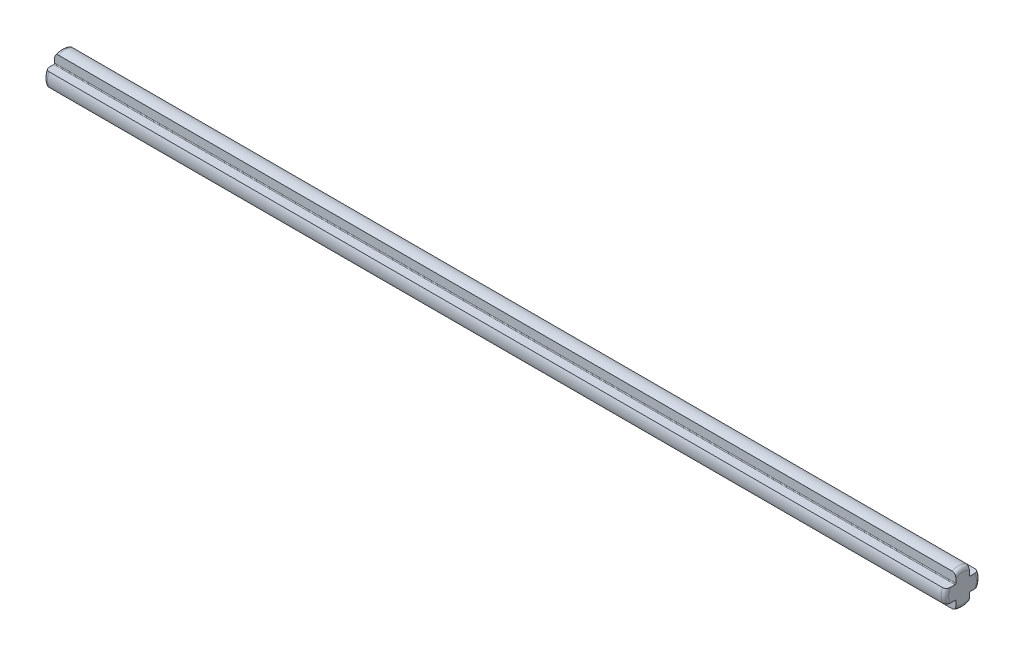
ISO-10303-21;
HEADER;
FILE_DESCRIPTION(('STEP AP214'),'2;1');
FILE_NAME('part.step','',(''),(''),'','','');
FILE_SCHEMA(('AUTOMOTIVE_DESIGN { 1 0 10303 214 1 1 1 1 }'));
ENDSEC;
DATA;
#1=APPLICATION_CONTEXT('core data for automotive mechanical design processes');
#2=APPLICATION_PROTOCOL_DEFINITION('international standard','automotive_design',2000,#1);
#3=PRODUCT_CONTEXT('',#1,'mechanical');
#4=PRODUCT('Part','Part','',(#3));
#5=PRODUCT_RELATED_PRODUCT_CATEGORY('part','',(#4));
#6=PRODUCT_DEFINITION_FORMATION('','',#4);
#7=PRODUCT_DEFINITION_CONTEXT('part definition',#1,'design');
#8=PRODUCT_DEFINITION('design','',#6,#7);
#9=PRODUCT_DEFINITION_SHAPE('','',#8);
#10=(LENGTH_UNIT() NAMED_UNIT(*) SI_UNIT(.MILLI.,.METRE.));
#11=(NAMED_UNIT(*) PLANE_ANGLE_UNIT() SI_UNIT($,.RADIAN.));
#12=(NAMED_UNIT(*) SI_UNIT($,.STERADIAN.) SOLID_ANGLE_UNIT());
#13=UNCERTAINTY_MEASURE_WITH_UNIT(LENGTH_MEASURE(1.E-05),#10,'distance_accuracy_value','');
#14=(GEOMETRIC_REPRESENTATION_CONTEXT(3) GLOBAL_UNCERTAINTY_ASSIGNED_CONTEXT((#13)) GLOBAL_UNIT_ASSIGNED_CONTEXT((#10,
#11,#12)) REPRESENTATION_CONTEXT('',''));
#15=CARTESIAN_POINT('',(0.,0.,0.));
#16=DIRECTION('',(0.,0.,1.));
#17=DIRECTION('',(1.,0.,0.));
#18=AXIS2_PLACEMENT_3D('',#15,#16,#17);
#19=CARTESIAN_POINT('',(60.,0.,0.));
#20=DIRECTION('',(-1.,0.,0.));
#21=DIRECTION('',(0.,0.,1.));
#22=AXIS2_PLACEMENT_3D('',#19,#20,#21);
#23=CYLINDRICAL_SURFACE('',#22,2.35);
#24=DIRECTION('',(-1.,0.,0.));
#25=VECTOR('',#24,1.);
#26=CARTESIAN_POINT('',(60.,0.9,2.17082933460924));
#27=LINE('',#26,#25);
#28=CARTESIAN_POINT('',(59.5,0.9,2.17082933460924));
#29=VERTEX_POINT('',#28);
#30=CARTESIAN_POINT('',(-59.5,0.9,2.17082933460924));
#31=VERTEX_POINT('',#30);
#32=EDGE_CURVE('E250',#29,#31,#27,.T.);
#33=ORIENTED_EDGE('',*,*,#32,.T.);
#34=CARTESIAN_POINT('',(-59.5,0.,0.));
#35=DIRECTION('',(1.,0.,0.));
#36=DIRECTION('',(0.,0.,-1.));
#37=AXIS2_PLACEMENT_3D('',#34,#35,#36);
#38=CIRCLE('',#37,2.35);
#39=CARTESIAN_POINT('',(-59.5,-0.900000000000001,2.17082933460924));
#40=VERTEX_POINT('',#39);
#41=EDGE_CURVE('E515',#31,#40,#38,.T.);
#42=ORIENTED_EDGE('',*,*,#41,.T.);
#43=DIRECTION('',(-1.,0.,0.));
#44=VECTOR('',#43,1.);
#45=CARTESIAN_POINT('',(60.,-0.900000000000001,2.17082933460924));
#46=LINE('',#45,#44);
#47=CARTESIAN_POINT('',(59.5,-0.900000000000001,2.17082933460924));
#48=VERTEX_POINT('',#47);
#49=EDGE_CURVE('E221',#48,#40,#46,.T.);
#50=ORIENTED_EDGE('',*,*,#49,.F.);
#51=CARTESIAN_POINT('',(59.5,0.,0.));
#52=DIRECTION('',(1.,0.,0.));
#53=DIRECTION('',(0.,0.,-1.));
#54=AXIS2_PLACEMENT_3D('',#51,#52,#53);
#55=CIRCLE('',#54,2.35);
#56=EDGE_CURVE('E370',#48,#29,#55,.F.);
#57=ORIENTED_EDGE('',*,*,#56,.T.);
#58=EDGE_LOOP('',(#33,#42,#50,#57));
#59=FACE_BOUND('',#58,.T.);
#60=ADVANCED_FACE('F37',(#59),#23,.T.);
#61=CARTESIAN_POINT('',(60.,-0.900000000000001,2.17082933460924));
#62=DIRECTION('',(0.,1.,0.));
#63=DIRECTION('',(0.,0.,1.));
#64=AXIS2_PLACEMENT_3D('',#61,#62,#63);
#65=PLANE('',#64);
#66=ORIENTED_EDGE('',*,*,#49,.T.);
#67=CARTESIAN_POINT('',(-59.5,-0.900000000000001,2.17082933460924));
#68=CARTESIAN_POINT('',(-59.5264833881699,-0.900000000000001,2.17085986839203));
#69=CARTESIAN_POINT('',(-59.5529498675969,-0.900000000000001,2.16855372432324));
#70=CARTESIAN_POINT('',(-59.6050453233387,-0.900000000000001,2.15950506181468));
#71=CARTESIAN_POINT('',(-59.6306762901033,-0.900000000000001,2.15277404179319));
#72=CARTESIAN_POINT('',(-59.6804387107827,-0.900000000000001,2.1351114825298));
#73=CARTESIAN_POINT('',(-59.7045703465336,-0.900000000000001,2.12418045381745));
#74=CARTESIAN_POINT('',(-59.7507251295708,-0.900000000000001,2.09852306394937));
#75=CARTESIAN_POINT('',(-59.7727475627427,-0.900000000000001,2.0837954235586));
#76=CARTESIAN_POINT('',(-59.8147234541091,-0.900000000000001,2.05060839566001));
#77=CARTESIAN_POINT('',(-59.8346070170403,-0.900000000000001,2.03206082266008));
#78=CARTESIAN_POINT('',(-59.8712243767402,-0.900000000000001,1.99209288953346));
#79=CARTESIAN_POINT('',(-59.8879579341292,-0.900000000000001,1.97067231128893));
#80=CARTESIAN_POINT('',(-59.9190973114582,-0.900000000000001,1.92396602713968));
#81=CARTESIAN_POINT('',(-59.9332527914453,-0.900000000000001,1.89851375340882));
#82=CARTESIAN_POINT('',(-59.9575247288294,-0.900000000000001,1.84573102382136));
#83=CARTESIAN_POINT('',(-59.9676367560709,-0.900000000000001,1.81839854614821));
#84=CARTESIAN_POINT('',(-59.9838866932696,-0.900000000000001,1.76219756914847));
#85=CARTESIAN_POINT('',(-59.9899702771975,-0.900000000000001,1.73331353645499));
#86=CARTESIAN_POINT('',(-59.9980270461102,-0.900000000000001,1.67505065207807));
#87=CARTESIAN_POINT('',(-60.0000109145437,-0.900000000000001,1.64567328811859));
#88=CARTESIAN_POINT('',(-60.,-0.900000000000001,1.61632298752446));
#89=B_SPLINE_CURVE_WITH_KNOTS('',3,(#67,#68,#69,#70,#71,#72,#73,#74,#75,#76,#77,#78,#79,#80,#81,
#82,#83,#84,#85,#86,#87,#88),.UNSPECIFIED.,.F.,.F.,(4,2,2,2,2,2,2,2,2,2,4),(0.,
0.0793238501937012,0.158442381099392,0.237551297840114,0.316686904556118,0.397909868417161,
0.479139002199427,0.56614777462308,0.653251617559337,0.74150740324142,0.829532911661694),.UNSPECIFIED.);
#90=CARTESIAN_POINT('',(-60.,-0.900000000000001,1.61632298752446));
#91=VERTEX_POINT('',#90);
#92=EDGE_CURVE('E390',#40,#91,#89,.T.);
#93=ORIENTED_EDGE('',*,*,#92,.T.);
#94=DIRECTION('',(0.,0.,-1.));
#95=VECTOR('',#94,1.);
#96=CARTESIAN_POINT('',(-60.,-0.900000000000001,2.17082933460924));
#97=LINE('',#96,#95);
#98=CARTESIAN_POINT('',(-60.,-0.900000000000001,0.999999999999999));
#99=VERTEX_POINT('',#98);
#100=EDGE_CURVE('E218',#91,#99,#97,.T.);
#101=ORIENTED_EDGE('',*,*,#100,.T.);
#102=DIRECTION('',(-1.,0.,0.));
#103=VECTOR('',#102,1.);
#104=CARTESIAN_POINT('',(60.,-0.900000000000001,0.999999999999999));
#105=LINE('',#104,#103);
#106=CARTESIAN_POINT('',(60.,-0.900000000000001,0.999999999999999));
#107=VERTEX_POINT('',#106);
#108=EDGE_CURVE('E214',#107,#99,#105,.T.);
#109=ORIENTED_EDGE('',*,*,#108,.F.);
#110=DIRECTION('',(0.,0.,-1.));
#111=VECTOR('',#110,1.);
#112=CARTESIAN_POINT('',(60.,-0.900000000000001,2.17082933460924));
#113=LINE('',#112,#111);
#114=CARTESIAN_POINT('',(60.,-0.900000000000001,1.61632298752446));
#115=VERTEX_POINT('',#114);
#116=EDGE_CURVE('E201',#115,#107,#113,.T.);
#117=ORIENTED_EDGE('',*,*,#116,.F.);
#118=CARTESIAN_POINT('',(60.,-0.900000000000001,1.61632298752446));
#119=CARTESIAN_POINT('',(60.0000222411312,-0.900000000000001,1.65066661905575));
#120=CARTESIAN_POINT('',(59.9972983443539,-0.900000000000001,1.68506058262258));
#121=CARTESIAN_POINT('',(59.9862156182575,-0.900000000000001,1.75308687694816));
#122=CARTESIAN_POINT('',(59.9778303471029,-0.900000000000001,1.78671486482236));
#123=CARTESIAN_POINT('',(59.9552419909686,-0.900000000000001,1.85211366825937));
#124=CARTESIAN_POINT('',(59.9410195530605,-0.900000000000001,1.88387790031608));
#125=CARTESIAN_POINT('',(59.9069131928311,-0.900000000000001,1.94414749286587));
#126=CARTESIAN_POINT('',(59.8870416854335,-0.900000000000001,1.97265980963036));
#127=CARTESIAN_POINT('',(59.844222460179,-0.900000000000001,2.02268935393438));
#128=CARTESIAN_POINT('',(59.8217526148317,-0.900000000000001,2.04461521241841));
#129=CARTESIAN_POINT('',(59.7730890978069,-0.900000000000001,2.08389547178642));
#130=CARTESIAN_POINT('',(59.7468952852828,-0.900000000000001,2.10124969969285));
#131=CARTESIAN_POINT('',(59.6943438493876,-0.900000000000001,2.12912089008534));
#132=CARTESIAN_POINT('',(59.6682509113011,-0.900000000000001,2.14013932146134));
#133=CARTESIAN_POINT('',(59.6145341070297,-0.900000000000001,2.15730052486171));
#134=CARTESIAN_POINT('',(59.586913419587,-0.900000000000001,2.1634530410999));
#135=CARTESIAN_POINT('',(59.5492135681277,-0.900000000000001,2.16830749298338));
#136=CARTESIAN_POINT('',(59.5393866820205,-0.900000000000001,2.1692533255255));
#137=CARTESIAN_POINT('',(59.5197081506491,-0.900000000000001,2.17051341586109));
#138=CARTESIAN_POINT('',(59.5098565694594,-0.900000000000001,2.17082867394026));
#139=CARTESIAN_POINT('',(59.5,-0.900000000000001,2.17082933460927));
#140=B_SPLINE_CURVE_WITH_KNOTS('',3,(#118,#119,#120,#121,#122,#123,#124,#125,#126,#127,#128,
#129,#130,#131,#132,#133,#134,#135,#136,#137,#138,#139),.UNSPECIFIED.,.F.,.F.,(4,2,2,2,2,2,2,2,
2,2,4),(0.,0.10300027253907,0.206484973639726,0.310315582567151,0.413919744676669,
0.507586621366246,0.601257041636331,0.68579977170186,0.770172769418,0.799774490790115,
0.829329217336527),.UNSPECIFIED.);
#141=EDGE_CURVE('E520',#115,#48,#140,.T.);
#142=ORIENTED_EDGE('',*,*,#141,.T.);
#143=EDGE_LOOP('',(#66,#93,#101,#109,#117,#142));
#144=FACE_BOUND('',#143,.T.);
#145=ADVANCED_FACE('F216',(#144),#65,.F.);
#146=CARTESIAN_POINT('',(60.,-1.,0.999999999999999));
#147=DIRECTION('',(-1.,0.,0.));
#148=DIRECTION('',(0.,0.,1.));
#149=AXIS2_PLACEMENT_3D('',#146,#147,#148);
#150=CYLINDRICAL_SURFACE('',#149,0.0999999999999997);
#151=CARTESIAN_POINT('',(-60.,-1.,0.999999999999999));
#152=DIRECTION('',(-1.,0.,0.));
#153=DIRECTION('',(0.,0.,1.));
#154=AXIS2_PLACEMENT_3D('',#151,#152,#153);
#155=CIRCLE('',#154,0.0999999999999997);
#156=CARTESIAN_POINT('',(-60.,-1.,0.899999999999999));
#157=VERTEX_POINT('',#156);
#158=EDGE_CURVE('E252',#99,#157,#155,.T.);
#159=ORIENTED_EDGE('',*,*,#158,.T.);
#160=DIRECTION('',(-1.,0.,0.));
#161=VECTOR('',#160,1.);
#162=CARTESIAN_POINT('',(60.,-1.,0.899999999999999));
#163=LINE('',#162,#161);
#164=CARTESIAN_POINT('',(60.,-1.,0.899999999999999));
#165=VERTEX_POINT('',#164);
#166=EDGE_CURVE('E222',#165,#157,#163,.T.);
#167=ORIENTED_EDGE('',*,*,#166,.F.);
#168=CARTESIAN_POINT('',(60.,-1.,0.999999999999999));
#169=DIRECTION('',(-1.,0.,0.));
#170=DIRECTION('',(0.,0.,1.));
#171=AXIS2_PLACEMENT_3D('',#168,#169,#170);
#172=CIRCLE('',#171,0.0999999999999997);
#173=EDGE_CURVE('E207',#107,#165,#172,.T.);
#174=ORIENTED_EDGE('',*,*,#173,.F.);
#175=ORIENTED_EDGE('',*,*,#108,.T.);
#176=EDGE_LOOP('',(#159,#167,#174,#175));
#177=FACE_BOUND('',#176,.T.);
#178=ADVANCED_FACE('F224',(#177),#150,.F.);
#179=CARTESIAN_POINT('',(60.,-2.17082933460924,0.899999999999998));
#180=DIRECTION('',(0.,0.,-1.));
#181=DIRECTION('',(0.,1.,0.));
#182=AXIS2_PLACEMENT_3D('',#179,#180,#181);
#183=PLANE('',#182);
#184=DIRECTION('',(0.,-1.,0.));
#185=VECTOR('',#184,1.);
#186=CARTESIAN_POINT('',(-60.,-2.17082933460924,0.899999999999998));
#187=LINE('',#186,#185);
#188=CARTESIAN_POINT('',(-60.,-1.61632298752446,0.899999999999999));
#189=VERTEX_POINT('',#188);
#190=EDGE_CURVE('E254',#157,#189,#187,.T.);
#191=ORIENTED_EDGE('',*,*,#190,.T.);
#192=CARTESIAN_POINT('',(-60.,-1.61632298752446,0.899999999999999));
#193=CARTESIAN_POINT('',(-60.0000222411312,-1.65066661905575,0.899999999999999));
#194=CARTESIAN_POINT('',(-59.9972983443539,-1.68506058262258,0.899999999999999));
#195=CARTESIAN_POINT('',(-59.9862156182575,-1.75308687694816,0.899999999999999));
#196=CARTESIAN_POINT('',(-59.9778303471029,-1.78671486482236,0.899999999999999));
#197=CARTESIAN_POINT('',(-59.9552419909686,-1.85211366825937,0.899999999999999));
#198=CARTESIAN_POINT('',(-59.9410195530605,-1.88387790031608,0.899999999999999));
#199=CARTESIAN_POINT('',(-59.9069131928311,-1.94414749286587,0.899999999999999));
#200=CARTESIAN_POINT('',(-59.8870416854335,-1.97265980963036,0.899999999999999));
#201=CARTESIAN_POINT('',(-59.844222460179,-2.02268935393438,0.899999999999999));
#202=CARTESIAN_POINT('',(-59.8217526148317,-2.04461521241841,0.899999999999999));
#203=CARTESIAN_POINT('',(-59.7730890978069,-2.08389547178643,0.899999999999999));
#204=CARTESIAN_POINT('',(-59.7468952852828,-2.10124969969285,0.899999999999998));
#205=CARTESIAN_POINT('',(-59.6943438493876,-2.12912089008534,0.899999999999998));
#206=CARTESIAN_POINT('',(-59.6682509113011,-2.14013932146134,0.899999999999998));
#207=CARTESIAN_POINT('',(-59.6145341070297,-2.15730052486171,0.899999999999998));
#208=CARTESIAN_POINT('',(-59.586913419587,-2.1634530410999,0.899999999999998));
#209=CARTESIAN_POINT('',(-59.5492135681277,-2.16830749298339,0.899999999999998));
#210=CARTESIAN_POINT('',(-59.5393866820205,-2.1692533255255,0.899999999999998));
#211=CARTESIAN_POINT('',(-59.5197081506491,-2.17051341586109,0.899999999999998));
#212=CARTESIAN_POINT('',(-59.5098565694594,-2.17082867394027,0.899999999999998));
#213=CARTESIAN_POINT('',(-59.5,-2.17082933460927,0.899999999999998));
#214=B_SPLINE_CURVE_WITH_KNOTS('',3,(#192,#193,#194,#195,#196,#197,#198,#199,#200,#201,#202,
#203,#204,#205,#206,#207,#208,#209,#210,#211,#212,#213),.UNSPECIFIED.,.F.,.F.,(4,2,2,2,2,2,2,2,
2,2,4),(0.,0.103000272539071,0.206484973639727,0.310315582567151,0.413919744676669,
0.507586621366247,0.601257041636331,0.68579977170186,0.770172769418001,0.799774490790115,
0.829329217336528),.UNSPECIFIED.);
#215=CARTESIAN_POINT('',(-59.5,-2.17082933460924,0.899999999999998));
#216=VERTEX_POINT('',#215);
#217=EDGE_CURVE('E365',#189,#216,#214,.T.);
#218=ORIENTED_EDGE('',*,*,#217,.T.);
#219=DIRECTION('',(-1.,0.,0.));
#220=VECTOR('',#219,1.);
#221=CARTESIAN_POINT('',(60.,-2.17082933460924,0.899999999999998));
#222=LINE('',#221,#220);
#223=CARTESIAN_POINT('',(59.5,-2.17082933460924,0.899999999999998));
#224=VERTEX_POINT('',#223);
#225=EDGE_CURVE('E312',#224,#216,#222,.T.);
#226=ORIENTED_EDGE('',*,*,#225,.F.);
#227=CARTESIAN_POINT('',(59.5,-2.17082933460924,0.899999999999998));
#228=CARTESIAN_POINT('',(59.5264833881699,-2.17085986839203,0.899999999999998));
#229=CARTESIAN_POINT('',(59.5529498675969,-2.16855372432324,0.899999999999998));
#230=CARTESIAN_POINT('',(59.6050453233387,-2.15950506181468,0.899999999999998));
#231=CARTESIAN_POINT('',(59.6306762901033,-2.15277404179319,0.899999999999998));
#232=CARTESIAN_POINT('',(59.6804387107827,-2.1351114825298,0.899999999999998));
#233=CARTESIAN_POINT('',(59.7045703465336,-2.12418045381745,0.899999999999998));
#234=CARTESIAN_POINT('',(59.7507251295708,-2.09852306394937,0.899999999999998));
#235=CARTESIAN_POINT('',(59.7727475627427,-2.0837954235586,0.899999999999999));
#236=CARTESIAN_POINT('',(59.8147234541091,-2.05060839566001,0.899999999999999));
#237=CARTESIAN_POINT('',(59.8346070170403,-2.03206082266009,0.899999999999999));
#238=CARTESIAN_POINT('',(59.8712243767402,-1.99209288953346,0.899999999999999));
#239=CARTESIAN_POINT('',(59.8879579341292,-1.97067231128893,0.899999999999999));
#240=CARTESIAN_POINT('',(59.9190973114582,-1.92396602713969,0.899999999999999));
#241=CARTESIAN_POINT('',(59.9332527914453,-1.89851375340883,0.899999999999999));
#242=CARTESIAN_POINT('',(59.9575247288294,-1.84573102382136,0.899999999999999));
#243=CARTESIAN_POINT('',(59.9676367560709,-1.81839854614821,0.899999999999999));
#244=CARTESIAN_POINT('',(59.9838866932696,-1.76219756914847,0.899999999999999));
#245=CARTESIAN_POINT('',(59.9899702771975,-1.733313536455,0.899999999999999));
#246=CARTESIAN_POINT('',(59.9980270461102,-1.67505065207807,0.899999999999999));
#247=CARTESIAN_POINT('',(60.0000109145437,-1.64567328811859,0.899999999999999));
#248=CARTESIAN_POINT('',(60.,-1.61632298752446,0.899999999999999));
#249=B_SPLINE_CURVE_WITH_KNOTS('',3,(#227,#228,#229,#230,#231,#232,#233,#234,#235,#236,#237,
#238,#239,#240,#241,#242,#243,#244,#245,#246,#247,#248),.UNSPECIFIED.,.F.,.F.,(4,2,2,2,2,2,2,2,
2,2,4),(0.,0.0793238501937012,0.158442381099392,0.237551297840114,0.316686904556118,
0.397909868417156,0.479139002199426,0.566147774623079,0.653251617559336,0.741507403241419,
0.829532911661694),.UNSPECIFIED.);
#250=CARTESIAN_POINT('',(60.,-1.61632298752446,0.899999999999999));
#251=VERTEX_POINT('',#250);
#252=EDGE_CURVE('E359',#224,#251,#249,.T.);
#253=ORIENTED_EDGE('',*,*,#252,.T.);
#254=DIRECTION('',(0.,-1.,0.));
#255=VECTOR('',#254,1.);
#256=CARTESIAN_POINT('',(60.,-2.17082933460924,0.899999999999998));
#257=LINE('',#256,#255);
#258=EDGE_CURVE('E227',#165,#251,#257,.T.);
#259=ORIENTED_EDGE('',*,*,#258,.F.);
#260=ORIENTED_EDGE('',*,*,#166,.T.);
#261=EDGE_LOOP('',(#191,#218,#226,#253,#259,#260));
#262=FACE_BOUND('',#261,.T.);
#263=ADVANCED_FACE('F350',(#262),#183,.F.);
#264=CARTESIAN_POINT('',(60.,0.,0.));
#265=DIRECTION('',(-1.,0.,0.));
#266=DIRECTION('',(0.,0.,1.));
#267=AXIS2_PLACEMENT_3D('',#264,#265,#266);
#268=CYLINDRICAL_SURFACE('',#267,2.35);
#269=ORIENTED_EDGE('',*,*,#225,.T.);
#270=CARTESIAN_POINT('',(-59.5,0.,0.));
#271=DIRECTION('',(1.,0.,0.));
#272=DIRECTION('',(0.,0.,-1.));
#273=AXIS2_PLACEMENT_3D('',#270,#271,#272);
#274=CIRCLE('',#273,2.35);
#275=CARTESIAN_POINT('',(-59.5,-2.17082933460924,-0.9));
#276=VERTEX_POINT('',#275);
#277=EDGE_CURVE('E319',#216,#276,#274,.T.);
#278=ORIENTED_EDGE('',*,*,#277,.T.);
#279=DIRECTION('',(-1.,0.,0.));
#280=VECTOR('',#279,1.);
#281=CARTESIAN_POINT('',(60.,-2.17082933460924,-0.9));
#282=LINE('',#281,#280);
#283=CARTESIAN_POINT('',(59.5,-2.17082933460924,-0.9));
#284=VERTEX_POINT('',#283);
#285=EDGE_CURVE('E309',#284,#276,#282,.T.);
#286=ORIENTED_EDGE('',*,*,#285,.F.);
#287=CARTESIAN_POINT('',(59.5,0.,0.));
#288=DIRECTION('',(1.,0.,0.));
#289=DIRECTION('',(0.,0.,-1.));
#290=AXIS2_PLACEMENT_3D('',#287,#288,#289);
#291=CIRCLE('',#290,2.35);
#292=EDGE_CURVE('E317',#284,#224,#291,.F.);
#293=ORIENTED_EDGE('',*,*,#292,.T.);
#294=EDGE_LOOP('',(#269,#278,#286,#293));
#295=FACE_BOUND('',#294,.T.);
#296=ADVANCED_FACE('F344',(#295),#268,.T.);
#297=CARTESIAN_POINT('',(60.,-2.17082933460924,-0.9));
#298=DIRECTION('',(0.,0.,1.));
#299=DIRECTION('',(0.,-1.,0.));
#300=AXIS2_PLACEMENT_3D('',#297,#298,#299);
#301=PLANE('',#300);
#302=ORIENTED_EDGE('',*,*,#285,.T.);
#303=CARTESIAN_POINT('',(-59.5,-2.17082933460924,-0.9));
#304=CARTESIAN_POINT('',(-59.5264833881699,-2.17085986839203,-0.9));
#305=CARTESIAN_POINT('',(-59.5529498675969,-2.16855372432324,-0.9));
#306=CARTESIAN_POINT('',(-59.6050453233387,-2.15950506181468,-0.9));
#307=CARTESIAN_POINT('',(-59.6306762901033,-2.15277404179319,-0.9));
#308=CARTESIAN_POINT('',(-59.6804387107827,-2.1351114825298,-0.9));
#309=CARTESIAN_POINT('',(-59.7045703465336,-2.12418045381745,-0.9));
#310=CARTESIAN_POINT('',(-59.7507251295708,-2.09852306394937,-0.9));
#311=CARTESIAN_POINT('',(-59.7727475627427,-2.0837954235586,-0.9));
#312=CARTESIAN_POINT('',(-59.8147234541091,-2.05060839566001,-0.9));
#313=CARTESIAN_POINT('',(-59.8346070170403,-2.03206082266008,-0.9));
#314=CARTESIAN_POINT('',(-59.8712243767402,-1.99209288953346,-0.9));
#315=CARTESIAN_POINT('',(-59.8879579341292,-1.97067231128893,-0.9));
#316=CARTESIAN_POINT('',(-59.9190973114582,-1.92396602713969,-0.9));
#317=CARTESIAN_POINT('',(-59.9332527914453,-1.89851375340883,-0.9));
#318=CARTESIAN_POINT('',(-59.9575247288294,-1.84573102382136,-0.9));
#319=CARTESIAN_POINT('',(-59.9676367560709,-1.81839854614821,-0.9));
#320=CARTESIAN_POINT('',(-59.9838866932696,-1.76219756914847,-0.9));
#321=CARTESIAN_POINT('',(-59.9899702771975,-1.73331353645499,-0.9));
#322=CARTESIAN_POINT('',(-59.9980270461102,-1.67505065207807,-0.9));
#323=CARTESIAN_POINT('',(-60.0000109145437,-1.64567328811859,-0.9));
#324=CARTESIAN_POINT('',(-60.,-1.61632298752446,-0.9));
#325=B_SPLINE_CURVE_WITH_KNOTS('',3,(#303,#304,#305,#306,#307,#308,#309,#310,#311,#312,#313,
#314,#315,#316,#317,#318,#319,#320,#321,#322,#323,#324),.UNSPECIFIED.,.F.,.F.,(4,2,2,2,2,2,2,2,
2,2,4),(0.,0.0793238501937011,0.158442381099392,0.237551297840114,0.316686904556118,
0.397909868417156,0.479139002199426,0.566147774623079,0.653251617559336,0.741507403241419,
0.829532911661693),.UNSPECIFIED.);
#326=CARTESIAN_POINT('',(-60.,-1.61632298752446,-0.9));
#327=VERTEX_POINT('',#326);
#328=EDGE_CURVE('E329',#276,#327,#325,.T.);
#329=ORIENTED_EDGE('',*,*,#328,.T.);
#330=DIRECTION('',(0.,1.,0.));
#331=VECTOR('',#330,1.);
#332=CARTESIAN_POINT('',(-60.,-2.17082933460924,-0.9));
#333=LINE('',#332,#331);
#334=CARTESIAN_POINT('',(-60.,-1.,-0.9));
#335=VERTEX_POINT('',#334);
#336=EDGE_CURVE('E257',#327,#335,#333,.T.);
#337=ORIENTED_EDGE('',*,*,#336,.T.);
#338=DIRECTION('',(-1.,0.,0.));
#339=VECTOR('',#338,1.);
#340=CARTESIAN_POINT('',(60.,-1.,-0.9));
#341=LINE('',#340,#339);
#342=CARTESIAN_POINT('',(60.,-1.,-0.9));
#343=VERTEX_POINT('',#342);
#344=EDGE_CURVE('E306',#343,#335,#341,.T.);
#345=ORIENTED_EDGE('',*,*,#344,.F.);
#346=DIRECTION('',(0.,1.,0.));
#347=VECTOR('',#346,1.);
#348=CARTESIAN_POINT('',(60.,-2.17082933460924,-0.9));
#349=LINE('',#348,#347);
#350=CARTESIAN_POINT('',(60.,-1.61632298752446,-0.9));
#351=VERTEX_POINT('',#350);
#352=EDGE_CURVE('E229',#351,#343,#349,.T.);
#353=ORIENTED_EDGE('',*,*,#352,.F.);
#354=CARTESIAN_POINT('',(60.,-1.61632298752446,-0.9));
#355=CARTESIAN_POINT('',(60.0000222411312,-1.65066661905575,-0.9));
#356=CARTESIAN_POINT('',(59.9972983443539,-1.68506058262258,-0.9));
#357=CARTESIAN_POINT('',(59.9862156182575,-1.75308687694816,-0.9));
#358=CARTESIAN_POINT('',(59.9778303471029,-1.78671486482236,-0.9));
#359=CARTESIAN_POINT('',(59.9552419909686,-1.85211366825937,-0.9));
#360=CARTESIAN_POINT('',(59.9410195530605,-1.88387790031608,-0.9));
#361=CARTESIAN_POINT('',(59.9069131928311,-1.94414749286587,-0.9));
#362=CARTESIAN_POINT('',(59.8870416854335,-1.97265980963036,-0.9));
#363=CARTESIAN_POINT('',(59.844222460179,-2.02268935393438,-0.9));
#364=CARTESIAN_POINT('',(59.8217526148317,-2.04461521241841,-0.9));
#365=CARTESIAN_POINT('',(59.7730890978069,-2.08389547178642,-0.9));
#366=CARTESIAN_POINT('',(59.7468952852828,-2.10124969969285,-0.9));
#367=CARTESIAN_POINT('',(59.6943438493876,-2.12912089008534,-0.9));
#368=CARTESIAN_POINT('',(59.6682509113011,-2.14013932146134,-0.9));
#369=CARTESIAN_POINT('',(59.6145341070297,-2.15730052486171,-0.9));
#370=CARTESIAN_POINT('',(59.586913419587,-2.1634530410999,-0.9));
#371=CARTESIAN_POINT('',(59.5492135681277,-2.16830749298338,-0.9));
#372=CARTESIAN_POINT('',(59.5393866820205,-2.1692533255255,-0.9));
#373=CARTESIAN_POINT('',(59.5197081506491,-2.17051341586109,-0.9));
#374=CARTESIAN_POINT('',(59.5098565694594,-2.17082867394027,-0.9));
#375=CARTESIAN_POINT('',(59.5,-2.17082933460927,-0.9));
#376=B_SPLINE_CURVE_WITH_KNOTS('',3,(#354,#355,#356,#357,#358,#359,#360,#361,#362,#363,#364,
#365,#366,#367,#368,#369,#370,#371,#372,#373,#374,#375),.UNSPECIFIED.,.F.,.F.,(4,2,2,2,2,2,2,2,
2,2,4),(0.,0.10300027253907,0.206484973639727,0.310315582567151,0.413919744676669,
0.507586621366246,0.601257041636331,0.68579977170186,0.770172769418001,0.799774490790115,
0.829329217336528),.UNSPECIFIED.);
#377=EDGE_CURVE('E322',#351,#284,#376,.T.);
#378=ORIENTED_EDGE('',*,*,#377,.T.);
#379=EDGE_LOOP('',(#302,#329,#337,#345,#353,#378));
#380=FACE_BOUND('',#379,.T.);
#381=ADVANCED_FACE('F338',(#380),#301,.F.);
#382=CARTESIAN_POINT('',(60.,-1.,-1.));
#383=DIRECTION('',(-1.,0.,0.));
#384=DIRECTION('',(0.,0.,1.));
#385=AXIS2_PLACEMENT_3D('',#382,#383,#384);
#386=CYLINDRICAL_SURFACE('',#385,0.0999999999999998);
#387=CARTESIAN_POINT('',(-60.,-1.,-1.));
#388=DIRECTION('',(-1.,0.,0.));
#389=DIRECTION('',(0.,0.,-1.));
#390=AXIS2_PLACEMENT_3D('',#387,#388,#389);
#391=CIRCLE('',#390,0.0999999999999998);
#392=CARTESIAN_POINT('',(-60.,-0.9,-1.));
#393=VERTEX_POINT('',#392);
#394=EDGE_CURVE('E259',#335,#393,#391,.T.);
#395=ORIENTED_EDGE('',*,*,#394,.T.);
#396=DIRECTION('',(-1.,0.,0.));
#397=VECTOR('',#396,1.);
#398=CARTESIAN_POINT('',(60.,-0.9,-1.));
#399=LINE('',#398,#397);
#400=CARTESIAN_POINT('',(60.,-0.9,-1.));
#401=VERTEX_POINT('',#400);
#402=EDGE_CURVE('E303',#401,#393,#399,.T.);
#403=ORIENTED_EDGE('',*,*,#402,.F.);
#404=CARTESIAN_POINT('',(60.,-1.,-1.));
#405=DIRECTION('',(-1.,0.,0.));
#406=DIRECTION('',(0.,0.,-1.));
#407=AXIS2_PLACEMENT_3D('',#404,#405,#406);
#408=CIRCLE('',#407,0.0999999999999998);
#409=EDGE_CURVE('E233',#343,#401,#408,.T.);
#410=ORIENTED_EDGE('',*,*,#409,.F.);
#411=ORIENTED_EDGE('',*,*,#344,.T.);
#412=EDGE_LOOP('',(#395,#403,#410,#411));
#413=FACE_BOUND('',#412,.T.);
#414=ADVANCED_FACE('F343',(#413),#386,.F.);
#415=CARTESIAN_POINT('',(60.,-0.900000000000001,-2.17082933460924));
#416=DIRECTION('',(0.,1.,0.));
#417=DIRECTION('',(0.,0.,1.));
#418=AXIS2_PLACEMENT_3D('',#415,#416,#417);
#419=PLANE('',#418);
#420=DIRECTION('',(0.,0.,-1.));
#421=VECTOR('',#420,1.);
#422=CARTESIAN_POINT('',(-60.,-0.900000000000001,-2.17082933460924));
#423=LINE('',#422,#421);
#424=CARTESIAN_POINT('',(-60.,-0.9,-1.61632298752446));
#425=VERTEX_POINT('',#424);
#426=EDGE_CURVE('E261',#393,#425,#423,.T.);
#427=ORIENTED_EDGE('',*,*,#426,.T.);
#428=CARTESIAN_POINT('',(-60.,-0.9,-1.61632298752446));
#429=CARTESIAN_POINT('',(-60.0000222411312,-0.9,-1.65066661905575));
#430=CARTESIAN_POINT('',(-59.9972983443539,-0.9,-1.68506058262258));
#431=CARTESIAN_POINT('',(-59.9862156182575,-0.9,-1.75308687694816));
#432=CARTESIAN_POINT('',(-59.9778303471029,-0.9,-1.78671486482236));
#433=CARTESIAN_POINT('',(-59.9552419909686,-0.9,-1.85211366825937));
#434=CARTESIAN_POINT('',(-59.9410195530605,-0.9,-1.88387790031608));
#435=CARTESIAN_POINT('',(-59.9069131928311,-0.9,-1.94414749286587));
#436=CARTESIAN_POINT('',(-59.8870416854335,-0.9,-1.97265980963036));
#437=CARTESIAN_POINT('',(-59.844222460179,-0.9,-2.02268935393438));
#438=CARTESIAN_POINT('',(-59.8217526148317,-0.900000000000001,-2.04461521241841));
#439=CARTESIAN_POINT('',(-59.7730890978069,-0.900000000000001,-2.08389547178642));
#440=CARTESIAN_POINT('',(-59.7468952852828,-0.900000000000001,-2.10124969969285));
#441=CARTESIAN_POINT('',(-59.6943438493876,-0.900000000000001,-2.12912089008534));
#442=CARTESIAN_POINT('',(-59.6682509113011,-0.900000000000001,-2.14013932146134));
#443=CARTESIAN_POINT('',(-59.6145341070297,-0.900000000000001,-2.15730052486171));
#444=CARTESIAN_POINT('',(-59.586913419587,-0.900000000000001,-2.1634530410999));
#445=CARTESIAN_POINT('',(-59.5492135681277,-0.900000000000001,-2.16830749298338));
#446=CARTESIAN_POINT('',(-59.5393866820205,-0.900000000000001,-2.1692533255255));
#447=CARTESIAN_POINT('',(-59.5197081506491,-0.900000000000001,-2.17051341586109));
#448=CARTESIAN_POINT('',(-59.5098565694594,-0.900000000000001,-2.17082867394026));
#449=CARTESIAN_POINT('',(-59.5,-0.900000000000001,-2.17082933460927));
#450=B_SPLINE_CURVE_WITH_KNOTS('',3,(#428,#429,#430,#431,#432,#433,#434,#435,#436,#437,#438,
#439,#440,#441,#442,#443,#444,#445,#446,#447,#448,#449),.UNSPECIFIED.,.F.,.F.,(4,2,2,2,2,2,2,2,
2,2,4),(0.,0.103000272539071,0.206484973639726,0.310315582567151,0.413919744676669,
0.507586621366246,0.601257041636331,0.68579977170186,0.770172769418,0.799774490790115,
0.829329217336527),.UNSPECIFIED.);
#451=CARTESIAN_POINT('',(-59.5,-0.9,-2.17082933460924));
#452=VERTEX_POINT('',#451);
#453=EDGE_CURVE('E489',#425,#452,#450,.T.);
#454=ORIENTED_EDGE('',*,*,#453,.T.);
#455=DIRECTION('',(-1.,0.,0.));
#456=VECTOR('',#455,1.);
#457=CARTESIAN_POINT('',(60.,-0.9,-2.17082933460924));
#458=LINE('',#457,#456);
#459=CARTESIAN_POINT('',(59.5,-0.9,-2.17082933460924));
#460=VERTEX_POINT('',#459);
#461=EDGE_CURVE('E300',#460,#452,#458,.T.);
#462=ORIENTED_EDGE('',*,*,#461,.F.);
#463=CARTESIAN_POINT('',(59.5,-0.9,-2.17082933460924));
#464=CARTESIAN_POINT('',(59.5264833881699,-0.9,-2.17085986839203));
#465=CARTESIAN_POINT('',(59.5529498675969,-0.900000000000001,-2.16855372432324));
#466=CARTESIAN_POINT('',(59.6050453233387,-0.900000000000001,-2.15950506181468));
#467=CARTESIAN_POINT('',(59.6306762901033,-0.900000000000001,-2.15277404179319));
#468=CARTESIAN_POINT('',(59.6804387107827,-0.900000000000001,-2.1351114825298));
#469=CARTESIAN_POINT('',(59.7045703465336,-0.900000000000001,-2.12418045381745));
#470=CARTESIAN_POINT('',(59.7507251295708,-0.900000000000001,-2.09852306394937));
#471=CARTESIAN_POINT('',(59.7727475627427,-0.900000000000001,-2.0837954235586));
#472=CARTESIAN_POINT('',(59.8147234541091,-0.900000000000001,-2.05060839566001));
#473=CARTESIAN_POINT('',(59.8346070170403,-0.9,-2.03206082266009));
#474=CARTESIAN_POINT('',(59.8712243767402,-0.9,-1.99209288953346));
#475=CARTESIAN_POINT('',(59.8879579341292,-0.9,-1.97067231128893));
#476=CARTESIAN_POINT('',(59.9190973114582,-0.9,-1.92396602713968));
#477=CARTESIAN_POINT('',(59.9332527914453,-0.9,-1.89851375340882));
#478=CARTESIAN_POINT('',(59.9575247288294,-0.9,-1.84573102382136));
#479=CARTESIAN_POINT('',(59.9676367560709,-0.9,-1.81839854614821));
#480=CARTESIAN_POINT('',(59.9838866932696,-0.9,-1.76219756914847));
#481=CARTESIAN_POINT('',(59.9899702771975,-0.9,-1.73331353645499));
#482=CARTESIAN_POINT('',(59.9980270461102,-0.9,-1.67505065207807));
#483=CARTESIAN_POINT('',(60.0000109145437,-0.9,-1.64567328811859));
#484=CARTESIAN_POINT('',(60.,-0.9,-1.61632298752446));
#485=B_SPLINE_CURVE_WITH_KNOTS('',3,(#463,#464,#465,#466,#467,#468,#469,#470,#471,#472,#473,
#474,#475,#476,#477,#478,#479,#480,#481,#482,#483,#484),.UNSPECIFIED.,.F.,.F.,(4,2,2,2,2,2,2,2,
2,2,4),(0.,0.0793238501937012,0.158442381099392,0.237551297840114,0.316686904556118,
0.397909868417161,0.479139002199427,0.56614777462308,0.653251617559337,0.74150740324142,
0.829532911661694),.UNSPECIFIED.);
#486=CARTESIAN_POINT('',(60.,-0.9,-1.61632298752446));
#487=VERTEX_POINT('',#486);
#488=EDGE_CURVE('E53',#460,#487,#485,.T.);
#489=ORIENTED_EDGE('',*,*,#488,.T.);
#490=DIRECTION('',(0.,0.,-1.));
#491=VECTOR('',#490,1.);
#492=CARTESIAN_POINT('',(60.,-0.900000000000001,-2.17082933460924));
#493=LINE('',#492,#491);
#494=EDGE_CURVE('E235',#401,#487,#493,.T.);
#495=ORIENTED_EDGE('',*,*,#494,.F.);
#496=ORIENTED_EDGE('',*,*,#402,.T.);
#497=EDGE_LOOP('',(#427,#454,#462,#489,#495,#496));
#498=FACE_BOUND('',#497,.T.);
#499=ADVANCED_FACE('F496',(#498),#419,.F.);
#500=CARTESIAN_POINT('',(60.,0.,0.));
#501=DIRECTION('',(-1.,0.,0.));
#502=DIRECTION('',(0.,0.,1.));
#503=AXIS2_PLACEMENT_3D('',#500,#501,#502);
#504=CYLINDRICAL_SURFACE('',#503,2.35);
#505=ORIENTED_EDGE('',*,*,#461,.T.);
#506=CARTESIAN_POINT('',(-59.5,0.,0.));
#507=DIRECTION('',(1.,0.,0.));
#508=DIRECTION('',(0.,0.,-1.));
#509=AXIS2_PLACEMENT_3D('',#506,#507,#508);
#510=CIRCLE('',#509,2.35);
#511=CARTESIAN_POINT('',(-59.5,0.900000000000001,-2.17082933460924));
#512=VERTEX_POINT('',#511);
#513=EDGE_CURVE('E575',#452,#512,#510,.T.);
#514=ORIENTED_EDGE('',*,*,#513,.T.);
#515=DIRECTION('',(-1.,0.,0.));
#516=VECTOR('',#515,1.);
#517=CARTESIAN_POINT('',(60.,0.900000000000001,-2.17082933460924));
#518=LINE('',#517,#516);
#519=CARTESIAN_POINT('',(59.5,0.900000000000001,-2.17082933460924));
#520=VERTEX_POINT('',#519);
#521=EDGE_CURVE('E297',#520,#512,#518,.T.);
#522=ORIENTED_EDGE('',*,*,#521,.F.);
#523=CARTESIAN_POINT('',(59.5,0.,0.));
#524=DIRECTION('',(1.,0.,0.));
#525=DIRECTION('',(0.,0.,-1.));
#526=AXIS2_PLACEMENT_3D('',#523,#524,#525);
#527=CIRCLE('',#526,2.35);
#528=EDGE_CURVE('E574',#520,#460,#527,.F.);
#529=ORIENTED_EDGE('',*,*,#528,.T.);
#530=EDGE_LOOP('',(#505,#514,#522,#529));
#531=FACE_BOUND('',#530,.T.);
#532=ADVANCED_FACE('F464',(#531),#504,.T.);
#533=CARTESIAN_POINT('',(60.,0.900000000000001,-2.17082933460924));
#534=DIRECTION('',(0.,-1.,0.));
#535=DIRECTION('',(0.,0.,-1.));
#536=AXIS2_PLACEMENT_3D('',#533,#534,#535);
#537=PLANE('',#536);
#538=ORIENTED_EDGE('',*,*,#521,.T.);
#539=CARTESIAN_POINT('',(-59.5,0.900000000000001,-2.17082933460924));
#540=CARTESIAN_POINT('',(-59.5264833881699,0.900000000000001,-2.17085986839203));
#541=CARTESIAN_POINT('',(-59.5529498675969,0.900000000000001,-2.16855372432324));
#542=CARTESIAN_POINT('',(-59.6050453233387,0.900000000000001,-2.15950506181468));
#543=CARTESIAN_POINT('',(-59.6306762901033,0.900000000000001,-2.15277404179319));
#544=CARTESIAN_POINT('',(-59.6804387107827,0.900000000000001,-2.1351114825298));
#545=CARTESIAN_POINT('',(-59.7045703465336,0.900000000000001,-2.12418045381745));
#546=CARTESIAN_POINT('',(-59.7507251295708,0.900000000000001,-2.09852306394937));
#547=CARTESIAN_POINT('',(-59.7727475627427,0.900000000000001,-2.0837954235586));
#548=CARTESIAN_POINT('',(-59.8147234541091,0.900000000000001,-2.05060839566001));
#549=CARTESIAN_POINT('',(-59.8346070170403,0.9,-2.03206082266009));
#550=CARTESIAN_POINT('',(-59.8712243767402,0.9,-1.99209288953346));
#551=CARTESIAN_POINT('',(-59.8879579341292,0.9,-1.97067231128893));
#552=CARTESIAN_POINT('',(-59.9190973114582,0.9,-1.92396602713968));
#553=CARTESIAN_POINT('',(-59.9332527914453,0.9,-1.89851375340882));
#554=CARTESIAN_POINT('',(-59.9575247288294,0.9,-1.84573102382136));
#555=CARTESIAN_POINT('',(-59.9676367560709,0.9,-1.81839854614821));
#556=CARTESIAN_POINT('',(-59.9838866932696,0.9,-1.76219756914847));
#557=CARTESIAN_POINT('',(-59.9899702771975,0.9,-1.73331353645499));
#558=CARTESIAN_POINT('',(-59.9980270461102,0.9,-1.67505065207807));
#559=CARTESIAN_POINT('',(-60.0000109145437,0.9,-1.64567328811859));
#560=CARTESIAN_POINT('',(-60.,0.9,-1.61632298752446));
#561=B_SPLINE_CURVE_WITH_KNOTS('',3,(#539,#540,#541,#542,#543,#544,#545,#546,#547,#548,#549,
#550,#551,#552,#553,#554,#555,#556,#557,#558,#559,#560),.UNSPECIFIED.,.F.,.F.,(4,2,2,2,2,2,2,2,
2,2,4),(0.,0.0793238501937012,0.158442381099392,0.237551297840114,0.316686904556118,
0.397909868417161,0.479139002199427,0.56614777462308,0.653251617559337,0.74150740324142,
0.829532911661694),.UNSPECIFIED.);
#562=CARTESIAN_POINT('',(-60.,0.9,-1.61632298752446));
#563=VERTEX_POINT('',#562);
#564=EDGE_CURVE('E473',#512,#563,#561,.T.);
#565=ORIENTED_EDGE('',*,*,#564,.T.);
#566=DIRECTION('',(0.,0.,1.));
#567=VECTOR('',#566,1.);
#568=CARTESIAN_POINT('',(-60.,0.900000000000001,-2.17082933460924));
#569=LINE('',#568,#567);
#570=CARTESIAN_POINT('',(-60.,0.9,-1.));
#571=VERTEX_POINT('',#570);
#572=EDGE_CURVE('E264',#563,#571,#569,.T.);
#573=ORIENTED_EDGE('',*,*,#572,.T.);
#574=DIRECTION('',(-1.,0.,0.));
#575=VECTOR('',#574,1.);
#576=CARTESIAN_POINT('',(60.,0.9,-1.));
#577=LINE('',#576,#575);
#578=CARTESIAN_POINT('',(60.,0.9,-1.));
#579=VERTEX_POINT('',#578);
#580=EDGE_CURVE('E294',#579,#571,#577,.T.);
#581=ORIENTED_EDGE('',*,*,#580,.F.);
#582=DIRECTION('',(0.,0.,1.));
#583=VECTOR('',#582,1.);
#584=CARTESIAN_POINT('',(60.,0.900000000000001,-2.17082933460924));
#585=LINE('',#584,#583);
#586=CARTESIAN_POINT('',(60.,0.9,-1.61632298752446));
#587=VERTEX_POINT('',#586);
#588=EDGE_CURVE('E237',#587,#579,#585,.T.);
#589=ORIENTED_EDGE('',*,*,#588,.F.);
#590=CARTESIAN_POINT('',(60.,0.9,-1.61632298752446));
#591=CARTESIAN_POINT('',(60.0000222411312,0.9,-1.65066661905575));
#592=CARTESIAN_POINT('',(59.9972983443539,0.9,-1.68506058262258));
#593=CARTESIAN_POINT('',(59.9862156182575,0.9,-1.75308687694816));
#594=CARTESIAN_POINT('',(59.9778303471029,0.9,-1.78671486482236));
#595=CARTESIAN_POINT('',(59.9552419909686,0.9,-1.85211366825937));
#596=CARTESIAN_POINT('',(59.9410195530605,0.9,-1.88387790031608));
#597=CARTESIAN_POINT('',(59.9069131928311,0.9,-1.94414749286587));
#598=CARTESIAN_POINT('',(59.8870416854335,0.9,-1.97265980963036));
#599=CARTESIAN_POINT('',(59.844222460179,0.9,-2.02268935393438));
#600=CARTESIAN_POINT('',(59.8217526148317,0.900000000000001,-2.04461521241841));
#601=CARTESIAN_POINT('',(59.7730890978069,0.900000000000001,-2.08389547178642));
#602=CARTESIAN_POINT('',(59.7468952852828,0.900000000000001,-2.10124969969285));
#603=CARTESIAN_POINT('',(59.6943438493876,0.900000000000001,-2.12912089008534));
#604=CARTESIAN_POINT('',(59.6682509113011,0.900000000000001,-2.14013932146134));
#605=CARTESIAN_POINT('',(59.6145341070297,0.900000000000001,-2.15730052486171));
#606=CARTESIAN_POINT('',(59.586913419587,0.900000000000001,-2.1634530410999));
#607=CARTESIAN_POINT('',(59.5492135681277,0.900000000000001,-2.16830749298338));
#608=CARTESIAN_POINT('',(59.5393866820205,0.900000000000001,-2.1692533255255));
#609=CARTESIAN_POINT('',(59.5197081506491,0.900000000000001,-2.17051341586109));
#610=CARTESIAN_POINT('',(59.5098565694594,0.900000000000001,-2.17082867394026));
#611=CARTESIAN_POINT('',(59.5,0.900000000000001,-2.17082933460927));
#612=B_SPLINE_CURVE_WITH_KNOTS('',3,(#590,#591,#592,#593,#594,#595,#596,#597,#598,#599,#600,
#601,#602,#603,#604,#605,#606,#607,#608,#609,#610,#611),.UNSPECIFIED.,.F.,.F.,(4,2,2,2,2,2,2,2,
2,2,4),(0.,0.103000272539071,0.206484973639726,0.310315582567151,0.413919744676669,
0.507586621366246,0.601257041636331,0.68579977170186,0.770172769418,0.799774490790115,
0.829329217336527),.UNSPECIFIED.);
#613=EDGE_CURVE('E61',#587,#520,#612,.T.);
#614=ORIENTED_EDGE('',*,*,#613,.T.);
#615=EDGE_LOOP('',(#538,#565,#573,#581,#589,#614));
#616=FACE_BOUND('',#615,.T.);
#617=ADVANCED_FACE('F459',(#616),#537,.F.);
#618=CARTESIAN_POINT('',(60.,1.,-1.));
#619=DIRECTION('',(-1.,0.,0.));
#620=DIRECTION('',(0.,0.,1.));
#621=AXIS2_PLACEMENT_3D('',#618,#619,#620);
#622=CYLINDRICAL_SURFACE('',#621,0.0999999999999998);
#623=CARTESIAN_POINT('',(-60.,1.,-1.));
#624=DIRECTION('',(-1.,0.,0.));
#625=DIRECTION('',(0.,0.,1.));
#626=AXIS2_PLACEMENT_3D('',#623,#624,#625);
#627=CIRCLE('',#626,0.0999999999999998);
#628=CARTESIAN_POINT('',(-60.,1.,-0.9));
#629=VERTEX_POINT('',#628);
#630=EDGE_CURVE('E266',#571,#629,#627,.T.);
#631=ORIENTED_EDGE('',*,*,#630,.T.);
#632=DIRECTION('',(-1.,0.,0.));
#633=VECTOR('',#632,1.);
#634=CARTESIAN_POINT('',(60.,1.,-0.9));
#635=LINE('',#634,#633);
#636=CARTESIAN_POINT('',(60.,1.,-0.9));
#637=VERTEX_POINT('',#636);
#638=EDGE_CURVE('E291',#637,#629,#635,.T.);
#639=ORIENTED_EDGE('',*,*,#638,.F.);
#640=CARTESIAN_POINT('',(60.,1.,-1.));
#641=DIRECTION('',(-1.,0.,0.));
#642=DIRECTION('',(0.,0.,1.));
#643=AXIS2_PLACEMENT_3D('',#640,#641,#642);
#644=CIRCLE('',#643,0.0999999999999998);
#645=EDGE_CURVE('E239',#579,#637,#644,.T.);
#646=ORIENTED_EDGE('',*,*,#645,.F.);
#647=ORIENTED_EDGE('',*,*,#580,.T.);
#648=EDGE_LOOP('',(#631,#639,#646,#647));
#649=FACE_BOUND('',#648,.T.);
#650=ADVANCED_FACE('F454',(#649),#622,.F.);
#651=CARTESIAN_POINT('',(60.,2.17082933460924,-0.9));
#652=DIRECTION('',(0.,0.,1.));
#653=DIRECTION('',(0.,-1.,0.));
#654=AXIS2_PLACEMENT_3D('',#651,#652,#653);
#655=PLANE('',#654);
#656=DIRECTION('',(0.,1.,0.));
#657=VECTOR('',#656,1.);
#658=CARTESIAN_POINT('',(-60.,2.17082933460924,-0.9));
#659=LINE('',#658,#657);
#660=CARTESIAN_POINT('',(-60.,1.61632298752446,-0.9));
#661=VERTEX_POINT('',#660);
#662=EDGE_CURVE('E268',#629,#661,#659,.T.);
#663=ORIENTED_EDGE('',*,*,#662,.T.);
#664=CARTESIAN_POINT('',(-60.,1.61632298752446,-0.9));
#665=CARTESIAN_POINT('',(-60.0000222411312,1.65066661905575,-0.9));
#666=CARTESIAN_POINT('',(-59.9972983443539,1.68506058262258,-0.9));
#667=CARTESIAN_POINT('',(-59.9862156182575,1.75308687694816,-0.9));
#668=CARTESIAN_POINT('',(-59.9778303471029,1.78671486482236,-0.9));
#669=CARTESIAN_POINT('',(-59.9552419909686,1.85211366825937,-0.9));
#670=CARTESIAN_POINT('',(-59.9410195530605,1.88387790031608,-0.9));
#671=CARTESIAN_POINT('',(-59.9069131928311,1.94414749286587,-0.9));
#672=CARTESIAN_POINT('',(-59.8870416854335,1.97265980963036,-0.9));
#673=CARTESIAN_POINT('',(-59.844222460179,2.02268935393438,-0.9));
#674=CARTESIAN_POINT('',(-59.8217526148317,2.04461521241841,-0.9));
#675=CARTESIAN_POINT('',(-59.7730890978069,2.08389547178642,-0.9));
#676=CARTESIAN_POINT('',(-59.7468952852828,2.10124969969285,-0.9));
#677=CARTESIAN_POINT('',(-59.6943438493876,2.12912089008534,-0.9));
#678=CARTESIAN_POINT('',(-59.6682509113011,2.14013932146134,-0.9));
#679=CARTESIAN_POINT('',(-59.6145341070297,2.15730052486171,-0.9));
#680=CARTESIAN_POINT('',(-59.586913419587,2.1634530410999,-0.9));
#681=CARTESIAN_POINT('',(-59.5492135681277,2.16830749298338,-0.9));
#682=CARTESIAN_POINT('',(-59.5393866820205,2.1692533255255,-0.9));
#683=CARTESIAN_POINT('',(-59.5197081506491,2.17051341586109,-0.9));
#684=CARTESIAN_POINT('',(-59.5098565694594,2.17082867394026,-0.9));
#685=CARTESIAN_POINT('',(-59.5,2.17082933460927,-0.9));
#686=B_SPLINE_CURVE_WITH_KNOTS('',3,(#664,#665,#666,#667,#668,#669,#670,#671,#672,#673,#674,
#675,#676,#677,#678,#679,#680,#681,#682,#683,#684,#685),.UNSPECIFIED.,.F.,.F.,(4,2,2,2,2,2,2,2,
2,2,4),(0.,0.10300027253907,0.206484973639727,0.310315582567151,0.413919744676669,
0.507586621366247,0.601257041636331,0.68579977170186,0.770172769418,0.799774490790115,
0.829329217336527),.UNSPECIFIED.);
#687=CARTESIAN_POINT('',(-59.5,2.17082933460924,-0.9));
#688=VERTEX_POINT('',#687);
#689=EDGE_CURVE('E445',#661,#688,#686,.T.);
#690=ORIENTED_EDGE('',*,*,#689,.T.);
#691=DIRECTION('',(-1.,0.,0.));
#692=VECTOR('',#691,1.);
#693=CARTESIAN_POINT('',(60.,2.17082933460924,-0.9));
#694=LINE('',#693,#692);
#695=CARTESIAN_POINT('',(59.5,2.17082933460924,-0.9));
#696=VERTEX_POINT('',#695);
#697=EDGE_CURVE('E288',#696,#688,#694,.T.);
#698=ORIENTED_EDGE('',*,*,#697,.F.);
#699=CARTESIAN_POINT('',(59.5,2.17082933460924,-0.9));
#700=CARTESIAN_POINT('',(59.5264833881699,2.17085986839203,-0.9));
#701=CARTESIAN_POINT('',(59.5529498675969,2.16855372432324,-0.9));
#702=CARTESIAN_POINT('',(59.6050453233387,2.15950506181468,-0.9));
#703=CARTESIAN_POINT('',(59.6306762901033,2.15277404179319,-0.9));
#704=CARTESIAN_POINT('',(59.6804387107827,2.1351114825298,-0.9));
#705=CARTESIAN_POINT('',(59.7045703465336,2.12418045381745,-0.9));
#706=CARTESIAN_POINT('',(59.7507251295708,2.09852306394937,-0.9));
#707=CARTESIAN_POINT('',(59.7727475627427,2.0837954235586,-0.9));
#708=CARTESIAN_POINT('',(59.8147234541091,2.05060839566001,-0.9));
#709=CARTESIAN_POINT('',(59.8346070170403,2.03206082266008,-0.9));
#710=CARTESIAN_POINT('',(59.8712243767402,1.99209288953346,-0.9));
#711=CARTESIAN_POINT('',(59.8879579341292,1.97067231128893,-0.9));
#712=CARTESIAN_POINT('',(59.9190973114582,1.92396602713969,-0.9));
#713=CARTESIAN_POINT('',(59.9332527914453,1.89851375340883,-0.9));
#714=CARTESIAN_POINT('',(59.9575247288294,1.84573102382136,-0.9));
#715=CARTESIAN_POINT('',(59.9676367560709,1.81839854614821,-0.9));
#716=CARTESIAN_POINT('',(59.9838866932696,1.76219756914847,-0.9));
#717=CARTESIAN_POINT('',(59.9899702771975,1.73331353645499,-0.9));
#718=CARTESIAN_POINT('',(59.9980270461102,1.67505065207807,-0.9));
#719=CARTESIAN_POINT('',(60.0000109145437,1.64567328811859,-0.9));
#720=CARTESIAN_POINT('',(60.,1.61632298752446,-0.9));
#721=B_SPLINE_CURVE_WITH_KNOTS('',3,(#699,#700,#701,#702,#703,#704,#705,#706,#707,#708,#709,
#710,#711,#712,#713,#714,#715,#716,#717,#718,#719,#720),.UNSPECIFIED.,.F.,.F.,(4,2,2,2,2,2,2,2,
2,2,4),(0.,0.0793238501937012,0.158442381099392,0.237551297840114,0.316686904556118,
0.397909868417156,0.479139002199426,0.566147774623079,0.653251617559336,0.741507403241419,
0.829532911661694),.UNSPECIFIED.);
#722=CARTESIAN_POINT('',(60.,1.61632298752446,-0.9));
#723=VERTEX_POINT('',#722);
#724=EDGE_CURVE('E440',#696,#723,#721,.T.);
#725=ORIENTED_EDGE('',*,*,#724,.T.);
#726=DIRECTION('',(0.,1.,0.));
#727=VECTOR('',#726,1.);
#728=CARTESIAN_POINT('',(60.,2.17082933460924,-0.9));
#729=LINE('',#728,#727);
#730=EDGE_CURVE('E241',#637,#723,#729,.T.);
#731=ORIENTED_EDGE('',*,*,#730,.F.);
#732=ORIENTED_EDGE('',*,*,#638,.T.);
#733=EDGE_LOOP('',(#663,#690,#698,#725,#731,#732));
#734=FACE_BOUND('',#733,.T.);
#735=ADVANCED_FACE('F450',(#734),#655,.F.);
#736=CARTESIAN_POINT('',(60.,0.,0.));
#737=DIRECTION('',(-1.,0.,0.));
#738=DIRECTION('',(0.,0.,1.));
#739=AXIS2_PLACEMENT_3D('',#736,#737,#738);
#740=CYLINDRICAL_SURFACE('',#739,2.35);
#741=ORIENTED_EDGE('',*,*,#697,.T.);
#742=CARTESIAN_POINT('',(-59.5,0.,0.));
#743=DIRECTION('',(1.,0.,0.));
#744=DIRECTION('',(0.,0.,-1.));
#745=AXIS2_PLACEMENT_3D('',#742,#743,#744);
#746=CIRCLE('',#745,2.35);
#747=CARTESIAN_POINT('',(-59.5,2.17082933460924,0.9));
#748=VERTEX_POINT('',#747);
#749=EDGE_CURVE('E572',#688,#748,#746,.T.);
#750=ORIENTED_EDGE('',*,*,#749,.T.);
#751=DIRECTION('',(-1.,0.,0.));
#752=VECTOR('',#751,1.);
#753=CARTESIAN_POINT('',(60.,2.17082933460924,0.9));
#754=LINE('',#753,#752);
#755=CARTESIAN_POINT('',(59.5,2.17082933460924,0.9));
#756=VERTEX_POINT('',#755);
#757=EDGE_CURVE('E285',#756,#748,#754,.T.);
#758=ORIENTED_EDGE('',*,*,#757,.F.);
#759=CARTESIAN_POINT('',(59.5,0.,0.));
#760=DIRECTION('',(1.,0.,0.));
#761=DIRECTION('',(0.,0.,-1.));
#762=AXIS2_PLACEMENT_3D('',#759,#760,#761);
#763=CIRCLE('',#762,2.35);
#764=EDGE_CURVE('E403',#756,#696,#763,.F.);
#765=ORIENTED_EDGE('',*,*,#764,.T.);
#766=EDGE_LOOP('',(#741,#750,#758,#765));
#767=FACE_BOUND('',#766,.T.);
#768=ADVANCED_FACE('F425',(#767),#740,.T.);
#769=CARTESIAN_POINT('',(60.,2.17082933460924,0.9));
#770=DIRECTION('',(0.,0.,-1.));
#771=DIRECTION('',(0.,1.,0.));
#772=AXIS2_PLACEMENT_3D('',#769,#770,#771);
#773=PLANE('',#772);
#774=ORIENTED_EDGE('',*,*,#757,.T.);
#775=CARTESIAN_POINT('',(-59.5,2.17082933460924,0.9));
#776=CARTESIAN_POINT('',(-59.5264833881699,2.17085986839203,0.9));
#777=CARTESIAN_POINT('',(-59.5529498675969,2.16855372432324,0.9));
#778=CARTESIAN_POINT('',(-59.6050453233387,2.15950506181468,0.9));
#779=CARTESIAN_POINT('',(-59.6306762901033,2.15277404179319,0.9));
#780=CARTESIAN_POINT('',(-59.6804387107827,2.1351114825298,0.9));
#781=CARTESIAN_POINT('',(-59.7045703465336,2.12418045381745,0.9));
#782=CARTESIAN_POINT('',(-59.7507251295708,2.09852306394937,0.9));
#783=CARTESIAN_POINT('',(-59.7727475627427,2.0837954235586,0.9));
#784=CARTESIAN_POINT('',(-59.8147234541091,2.05060839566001,0.9));
#785=CARTESIAN_POINT('',(-59.8346070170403,2.03206082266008,0.9));
#786=CARTESIAN_POINT('',(-59.8712243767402,1.99209288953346,0.9));
#787=CARTESIAN_POINT('',(-59.8879579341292,1.97067231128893,0.9));
#788=CARTESIAN_POINT('',(-59.9190973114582,1.92396602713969,0.9));
#789=CARTESIAN_POINT('',(-59.9332527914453,1.89851375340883,0.9));
#790=CARTESIAN_POINT('',(-59.9575247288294,1.84573102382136,0.9));
#791=CARTESIAN_POINT('',(-59.9676367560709,1.81839854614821,0.9));
#792=CARTESIAN_POINT('',(-59.9838866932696,1.76219756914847,0.9));
#793=CARTESIAN_POINT('',(-59.9899702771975,1.73331353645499,0.9));
#794=CARTESIAN_POINT('',(-59.9980270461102,1.67505065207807,0.9));
#795=CARTESIAN_POINT('',(-60.0000109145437,1.64567328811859,0.9));
#796=CARTESIAN_POINT('',(-60.,1.61632298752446,0.9));
#797=B_SPLINE_CURVE_WITH_KNOTS('',3,(#775,#776,#777,#778,#779,#780,#781,#782,#783,#784,#785,
#786,#787,#788,#789,#790,#791,#792,#793,#794,#795,#796),.UNSPECIFIED.,.F.,.F.,(4,2,2,2,2,2,2,2,
2,2,4),(0.,0.0793238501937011,0.158442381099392,0.237551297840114,0.316686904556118,
0.397909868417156,0.479139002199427,0.566147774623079,0.653251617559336,0.741507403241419,
0.829532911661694),.UNSPECIFIED.);
#798=CARTESIAN_POINT('',(-60.,1.61632298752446,0.9));
#799=VERTEX_POINT('',#798);
#800=EDGE_CURVE('E435',#748,#799,#797,.T.);
#801=ORIENTED_EDGE('',*,*,#800,.T.);
#802=DIRECTION('',(0.,-1.,0.));
#803=VECTOR('',#802,1.);
#804=CARTESIAN_POINT('',(-60.,2.17082933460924,0.9));
#805=LINE('',#804,#803);
#806=CARTESIAN_POINT('',(-60.,1.,0.9));
#807=VERTEX_POINT('',#806);
#808=EDGE_CURVE('E271',#799,#807,#805,.T.);
#809=ORIENTED_EDGE('',*,*,#808,.T.);
#810=DIRECTION('',(-1.,0.,0.));
#811=VECTOR('',#810,1.);
#812=CARTESIAN_POINT('',(60.,1.,0.9));
#813=LINE('',#812,#811);
#814=CARTESIAN_POINT('',(60.,1.,0.9));
#815=VERTEX_POINT('',#814);
#816=EDGE_CURVE('E282',#815,#807,#813,.T.);
#817=ORIENTED_EDGE('',*,*,#816,.F.);
#818=DIRECTION('',(0.,-1.,0.));
#819=VECTOR('',#818,1.);
#820=CARTESIAN_POINT('',(60.,2.17082933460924,0.9));
#821=LINE('',#820,#819);
#822=CARTESIAN_POINT('',(60.,1.61632298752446,0.9));
#823=VERTEX_POINT('',#822);
#824=EDGE_CURVE('E244',#823,#815,#821,.T.);
#825=ORIENTED_EDGE('',*,*,#824,.F.);
#826=CARTESIAN_POINT('',(60.,1.61632298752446,0.9));
#827=CARTESIAN_POINT('',(60.0000222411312,1.65066661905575,0.9));
#828=CARTESIAN_POINT('',(59.9972983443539,1.68506058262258,0.9));
#829=CARTESIAN_POINT('',(59.9862156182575,1.75308687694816,0.9));
#830=CARTESIAN_POINT('',(59.9778303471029,1.78671486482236,0.9));
#831=CARTESIAN_POINT('',(59.9552419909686,1.85211366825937,0.9));
#832=CARTESIAN_POINT('',(59.9410195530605,1.88387790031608,0.9));
#833=CARTESIAN_POINT('',(59.9069131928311,1.94414749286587,0.9));
#834=CARTESIAN_POINT('',(59.8870416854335,1.97265980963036,0.9));
#835=CARTESIAN_POINT('',(59.844222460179,2.02268935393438,0.9));
#836=CARTESIAN_POINT('',(59.8217526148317,2.04461521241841,0.9));
#837=CARTESIAN_POINT('',(59.7730890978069,2.08389547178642,0.9));
#838=CARTESIAN_POINT('',(59.7468952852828,2.10124969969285,0.9));
#839=CARTESIAN_POINT('',(59.6943438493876,2.12912089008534,0.9));
#840=CARTESIAN_POINT('',(59.6682509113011,2.14013932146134,0.9));
#841=CARTESIAN_POINT('',(59.6145341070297,2.15730052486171,0.9));
#842=CARTESIAN_POINT('',(59.586913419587,2.1634530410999,0.9));
#843=CARTESIAN_POINT('',(59.5492135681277,2.16830749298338,0.9));
#844=CARTESIAN_POINT('',(59.5393866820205,2.1692533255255,0.9));
#845=CARTESIAN_POINT('',(59.5197081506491,2.17051341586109,0.9));
#846=CARTESIAN_POINT('',(59.5098565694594,2.17082867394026,0.9));
#847=CARTESIAN_POINT('',(59.5,2.17082933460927,0.9));
#848=B_SPLINE_CURVE_WITH_KNOTS('',3,(#826,#827,#828,#829,#830,#831,#832,#833,#834,#835,#836,
#837,#838,#839,#840,#841,#842,#843,#844,#845,#846,#847),.UNSPECIFIED.,.F.,.F.,(4,2,2,2,2,2,2,2,
2,2,4),(0.,0.103000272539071,0.206484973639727,0.310315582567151,0.413919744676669,
0.507586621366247,0.601257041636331,0.68579977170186,0.770172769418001,0.799774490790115,
0.829329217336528),.UNSPECIFIED.);
#849=EDGE_CURVE('E430',#823,#756,#848,.T.);
#850=ORIENTED_EDGE('',*,*,#849,.T.);
#851=EDGE_LOOP('',(#774,#801,#809,#817,#825,#850));
#852=FACE_BOUND('',#851,.T.);
#853=ADVANCED_FACE('F420',(#852),#773,.F.);
#854=CARTESIAN_POINT('',(60.,1.,1.));
#855=DIRECTION('',(-1.,0.,0.));
#856=DIRECTION('',(0.,0.,1.));
#857=AXIS2_PLACEMENT_3D('',#854,#855,#856);
#858=CYLINDRICAL_SURFACE('',#857,0.0999999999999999);
#859=CARTESIAN_POINT('',(-60.,1.,1.));
#860=DIRECTION('',(-1.,0.,0.));
#861=DIRECTION('',(0.,0.,-1.));
#862=AXIS2_PLACEMENT_3D('',#859,#860,#861);
#863=CIRCLE('',#862,0.0999999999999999);
#864=CARTESIAN_POINT('',(-60.,0.9,1.));
#865=VERTEX_POINT('',#864);
#866=EDGE_CURVE('E273',#807,#865,#863,.T.);
#867=ORIENTED_EDGE('',*,*,#866,.T.);
#868=DIRECTION('',(-1.,0.,0.));
#869=VECTOR('',#868,1.);
#870=CARTESIAN_POINT('',(60.,0.9,1.));
#871=LINE('',#870,#869);
#872=CARTESIAN_POINT('',(60.,0.9,1.));
#873=VERTEX_POINT('',#872);
#874=EDGE_CURVE('E279',#873,#865,#871,.T.);
#875=ORIENTED_EDGE('',*,*,#874,.F.);
#876=CARTESIAN_POINT('',(60.,1.,1.));
#877=DIRECTION('',(-1.,0.,0.));
#878=DIRECTION('',(0.,0.,-1.));
#879=AXIS2_PLACEMENT_3D('',#876,#877,#878);
#880=CIRCLE('',#879,0.0999999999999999);
#881=EDGE_CURVE('E246',#815,#873,#880,.T.);
#882=ORIENTED_EDGE('',*,*,#881,.F.);
#883=ORIENTED_EDGE('',*,*,#816,.T.);
#884=EDGE_LOOP('',(#867,#875,#882,#883));
#885=FACE_BOUND('',#884,.T.);
#886=ADVANCED_FACE('F414',(#885),#858,.F.);
#887=CARTESIAN_POINT('',(60.,0.9,2.17082933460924));
#888=DIRECTION('',(0.,-1.,0.));
#889=DIRECTION('',(0.,0.,-1.));
#890=AXIS2_PLACEMENT_3D('',#887,#888,#889);
#891=PLANE('',#890);
#892=DIRECTION('',(0.,0.,1.));
#893=VECTOR('',#892,1.);
#894=CARTESIAN_POINT('',(-60.,0.9,2.17082933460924));
#895=LINE('',#894,#893);
#896=CARTESIAN_POINT('',(-60.,0.9,1.61632298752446));
#897=VERTEX_POINT('',#896);
#898=EDGE_CURVE('E211',#865,#897,#895,.T.);
#899=ORIENTED_EDGE('',*,*,#898,.T.);
#900=CARTESIAN_POINT('',(-60.,0.9,1.61632298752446));
#901=CARTESIAN_POINT('',(-60.0000222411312,0.9,1.65066661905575));
#902=CARTESIAN_POINT('',(-59.9972983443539,0.9,1.68506058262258));
#903=CARTESIAN_POINT('',(-59.9862156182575,0.9,1.75308687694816));
#904=CARTESIAN_POINT('',(-59.9778303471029,0.9,1.78671486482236));
#905=CARTESIAN_POINT('',(-59.9552419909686,0.9,1.85211366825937));
#906=CARTESIAN_POINT('',(-59.9410195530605,0.9,1.88387790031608));
#907=CARTESIAN_POINT('',(-59.9069131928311,0.9,1.94414749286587));
#908=CARTESIAN_POINT('',(-59.8870416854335,0.9,1.97265980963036));
#909=CARTESIAN_POINT('',(-59.844222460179,0.9,2.02268935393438));
#910=CARTESIAN_POINT('',(-59.8217526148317,0.9,2.04461521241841));
#911=CARTESIAN_POINT('',(-59.7730890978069,0.9,2.08389547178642));
#912=CARTESIAN_POINT('',(-59.7468952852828,0.9,2.10124969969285));
#913=CARTESIAN_POINT('',(-59.6943438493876,0.9,2.12912089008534));
#914=CARTESIAN_POINT('',(-59.6682509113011,0.9,2.14013932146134));
#915=CARTESIAN_POINT('',(-59.6145341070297,0.9,2.15730052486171));
#916=CARTESIAN_POINT('',(-59.586913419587,0.9,2.1634530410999));
#917=CARTESIAN_POINT('',(-59.5492135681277,0.9,2.16830749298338));
#918=CARTESIAN_POINT('',(-59.5393866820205,0.9,2.1692533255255));
#919=CARTESIAN_POINT('',(-59.5197081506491,0.9,2.17051341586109));
#920=CARTESIAN_POINT('',(-59.5098565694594,0.9,2.17082867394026));
#921=CARTESIAN_POINT('',(-59.5,0.9,2.17082933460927));
#922=B_SPLINE_CURVE_WITH_KNOTS('',3,(#900,#901,#902,#903,#904,#905,#906,#907,#908,#909,#910,
#911,#912,#913,#914,#915,#916,#917,#918,#919,#920,#921),.UNSPECIFIED.,.F.,.F.,(4,2,2,2,2,2,2,2,
2,2,4),(0.,0.10300027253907,0.206484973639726,0.310315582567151,0.413919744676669,
0.507586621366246,0.601257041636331,0.68579977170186,0.770172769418,0.799774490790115,
0.829329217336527),.UNSPECIFIED.);
#923=EDGE_CURVE('E397',#897,#31,#922,.T.);
#924=ORIENTED_EDGE('',*,*,#923,.T.);
#925=ORIENTED_EDGE('',*,*,#32,.F.);
#926=CARTESIAN_POINT('',(59.5,0.9,2.17082933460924));
#927=CARTESIAN_POINT('',(59.5264833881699,0.9,2.17085986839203));
#928=CARTESIAN_POINT('',(59.5529498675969,0.9,2.16855372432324));
#929=CARTESIAN_POINT('',(59.6050453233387,0.9,2.15950506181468));
#930=CARTESIAN_POINT('',(59.6306762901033,0.9,2.15277404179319));
#931=CARTESIAN_POINT('',(59.6804387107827,0.9,2.1351114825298));
#932=CARTESIAN_POINT('',(59.7045703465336,0.9,2.12418045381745));
#933=CARTESIAN_POINT('',(59.7507251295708,0.9,2.09852306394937));
#934=CARTESIAN_POINT('',(59.7727475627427,0.9,2.0837954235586));
#935=CARTESIAN_POINT('',(59.8147234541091,0.9,2.05060839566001));
#936=CARTESIAN_POINT('',(59.8346070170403,0.9,2.03206082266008));
#937=CARTESIAN_POINT('',(59.8712243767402,0.9,1.99209288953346));
#938=CARTESIAN_POINT('',(59.8879579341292,0.9,1.97067231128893));
#939=CARTESIAN_POINT('',(59.9190973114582,0.9,1.92396602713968));
#940=CARTESIAN_POINT('',(59.9332527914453,0.9,1.89851375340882));
#941=CARTESIAN_POINT('',(59.9575247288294,0.9,1.84573102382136));
#942=CARTESIAN_POINT('',(59.9676367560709,0.9,1.81839854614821));
#943=CARTESIAN_POINT('',(59.9838866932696,0.9,1.76219756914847));
#944=CARTESIAN_POINT('',(59.9899702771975,0.9,1.73331353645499));
#945=CARTESIAN_POINT('',(59.9980270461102,0.9,1.67505065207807));
#946=CARTESIAN_POINT('',(60.0000109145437,0.9,1.64567328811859));
#947=CARTESIAN_POINT('',(60.,0.9,1.61632298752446));
#948=B_SPLINE_CURVE_WITH_KNOTS('',3,(#926,#927,#928,#929,#930,#931,#932,#933,#934,#935,#936,
#937,#938,#939,#940,#941,#942,#943,#944,#945,#946,#947),.UNSPECIFIED.,.F.,.F.,(4,2,2,2,2,2,2,2,
2,2,4),(0.,0.0793238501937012,0.158442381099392,0.237551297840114,0.316686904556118,
0.397909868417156,0.479139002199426,0.566147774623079,0.653251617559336,0.741507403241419,
0.829532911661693),.UNSPECIFIED.);
#949=CARTESIAN_POINT('',(60.,0.9,1.61632298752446));
#950=VERTEX_POINT('',#949);
#951=EDGE_CURVE('E404',#29,#950,#948,.T.);
#952=ORIENTED_EDGE('',*,*,#951,.T.);
#953=DIRECTION('',(0.,0.,1.));
#954=VECTOR('',#953,1.);
#955=CARTESIAN_POINT('',(60.,0.9,2.17082933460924));
#956=LINE('',#955,#954);
#957=EDGE_CURVE('E248',#873,#950,#956,.T.);
#958=ORIENTED_EDGE('',*,*,#957,.F.);
#959=ORIENTED_EDGE('',*,*,#874,.T.);
#960=EDGE_LOOP('',(#899,#924,#925,#952,#958,#959));
#961=FACE_BOUND('',#960,.T.);
#962=ADVANCED_FACE('F409',(#961),#891,.F.);
#963=CARTESIAN_POINT('',(60.,0.,0.));
#964=DIRECTION('',(1.,0.,0.));
#965=DIRECTION('',(0.,0.,-1.));
#966=AXIS2_PLACEMENT_3D('',#963,#964,#965);
#967=PLANE('',#966);
#968=ORIENTED_EDGE('',*,*,#957,.T.);
#969=CARTESIAN_POINT('',(60.,0.,0.));
#970=DIRECTION('',(1.,0.,0.));
#971=DIRECTION('',(0.,0.,-1.));
#972=AXIS2_PLACEMENT_3D('',#969,#970,#971);
#973=CIRCLE('',#972,1.85);
#974=EDGE_CURVE('E11',#950,#115,#973,.T.);
#975=ORIENTED_EDGE('',*,*,#974,.T.);
#976=ORIENTED_EDGE('',*,*,#116,.T.);
#977=ORIENTED_EDGE('',*,*,#173,.T.);
#978=ORIENTED_EDGE('',*,*,#258,.T.);
#979=CARTESIAN_POINT('',(60.,0.,0.));
#980=DIRECTION('',(1.,0.,0.));
#981=DIRECTION('',(0.,0.,-1.));
#982=AXIS2_PLACEMENT_3D('',#979,#980,#981);
#983=CIRCLE('',#982,1.85);
#984=EDGE_CURVE('E46',#251,#351,#983,.T.);
#985=ORIENTED_EDGE('',*,*,#984,.T.);
#986=ORIENTED_EDGE('',*,*,#352,.T.);
#987=ORIENTED_EDGE('',*,*,#409,.T.);
#988=ORIENTED_EDGE('',*,*,#494,.T.);
#989=CARTESIAN_POINT('',(60.,0.,0.));
#990=DIRECTION('',(1.,0.,0.));
#991=DIRECTION('',(0.,0.,-1.));
#992=AXIS2_PLACEMENT_3D('',#989,#990,#991);
#993=CIRCLE('',#992,1.85);
#994=EDGE_CURVE('E581',#487,#587,#993,.T.);
#995=ORIENTED_EDGE('',*,*,#994,.T.);
#996=ORIENTED_EDGE('',*,*,#588,.T.);
#997=ORIENTED_EDGE('',*,*,#645,.T.);
#998=ORIENTED_EDGE('',*,*,#730,.T.);
#999=CARTESIAN_POINT('',(60.,0.,0.));
#1000=DIRECTION('',(1.,0.,0.));
#1001=DIRECTION('',(0.,0.,-1.));
#1002=AXIS2_PLACEMENT_3D('',#999,#1000,#1001);
#1003=CIRCLE('',#1002,1.85);
#1004=EDGE_CURVE('E494',#723,#823,#1003,.T.);
#1005=ORIENTED_EDGE('',*,*,#1004,.T.);
#1006=ORIENTED_EDGE('',*,*,#824,.T.);
#1007=ORIENTED_EDGE('',*,*,#881,.T.);
#1008=EDGE_LOOP('',(#968,#975,#976,#977,#978,#985,#986,#987,#988,#995,#996,#997,#998,#1005,
#1006,#1007));
#1009=FACE_BOUND('',#1008,.T.);
#1010=ADVANCED_FACE('F204',(#1009),#967,.T.);
#1011=CARTESIAN_POINT('',(-60.,0.,0.));
#1012=DIRECTION('',(1.,0.,0.));
#1013=DIRECTION('',(0.,0.,-1.));
#1014=AXIS2_PLACEMENT_3D('',#1011,#1012,#1013);
#1015=PLANE('',#1014);
#1016=ORIENTED_EDGE('',*,*,#336,.F.);
#1017=CARTESIAN_POINT('',(-60.,0.,0.));
#1018=DIRECTION('',(1.,0.,0.));
#1019=DIRECTION('',(0.,0.,-1.));
#1020=AXIS2_PLACEMENT_3D('',#1017,#1018,#1019);
#1021=CIRCLE('',#1020,1.85);
#1022=EDGE_CURVE('E544',#327,#189,#1021,.F.);
#1023=ORIENTED_EDGE('',*,*,#1022,.T.);
#1024=ORIENTED_EDGE('',*,*,#190,.F.);
#1025=ORIENTED_EDGE('',*,*,#158,.F.);
#1026=ORIENTED_EDGE('',*,*,#100,.F.);
#1027=CARTESIAN_POINT('',(-60.,0.,0.));
#1028=DIRECTION('',(1.,0.,0.));
#1029=DIRECTION('',(0.,0.,-1.));
#1030=AXIS2_PLACEMENT_3D('',#1027,#1028,#1029);
#1031=CIRCLE('',#1030,1.85);
#1032=EDGE_CURVE('E545',#91,#897,#1031,.F.);
#1033=ORIENTED_EDGE('',*,*,#1032,.T.);
#1034=ORIENTED_EDGE('',*,*,#898,.F.);
#1035=ORIENTED_EDGE('',*,*,#866,.F.);
#1036=ORIENTED_EDGE('',*,*,#808,.F.);
#1037=CARTESIAN_POINT('',(-60.,0.,0.));
#1038=DIRECTION('',(1.,0.,0.));
#1039=DIRECTION('',(0.,0.,-1.));
#1040=AXIS2_PLACEMENT_3D('',#1037,#1038,#1039);
#1041=CIRCLE('',#1040,1.85);
#1042=EDGE_CURVE('E550',#799,#661,#1041,.F.);
#1043=ORIENTED_EDGE('',*,*,#1042,.T.);
#1044=ORIENTED_EDGE('',*,*,#662,.F.);
#1045=ORIENTED_EDGE('',*,*,#630,.F.);
#1046=ORIENTED_EDGE('',*,*,#572,.F.);
#1047=CARTESIAN_POINT('',(-60.,0.,0.));
#1048=DIRECTION('',(1.,0.,0.));
#1049=DIRECTION('',(0.,0.,-1.));
#1050=AXIS2_PLACEMENT_3D('',#1047,#1048,#1049);
#1051=CIRCLE('',#1050,1.85);
#1052=EDGE_CURVE('E553',#563,#425,#1051,.F.);
#1053=ORIENTED_EDGE('',*,*,#1052,.T.);
#1054=ORIENTED_EDGE('',*,*,#426,.F.);
#1055=ORIENTED_EDGE('',*,*,#394,.F.);
#1056=EDGE_LOOP('',(#1016,#1023,#1024,#1025,#1026,#1033,#1034,#1035,#1036,#1043,#1044,#1045,
#1046,#1053,#1054,#1055));
#1057=FACE_BOUND('',#1056,.T.);
#1058=ADVANCED_FACE('F378',(#1057),#1015,.F.);
#1059=CARTESIAN_POINT('',(-59.5,0.,0.));
#1060=DIRECTION('',(1.,0.,0.));
#1061=DIRECTION('',(0.,0.,-1.));
#1062=AXIS2_PLACEMENT_3D('',#1059,#1060,#1061);
#1063=TOROIDAL_SURFACE('',#1062,1.85,0.5);
#1064=ORIENTED_EDGE('',*,*,#217,.F.);
#1065=ORIENTED_EDGE('',*,*,#1022,.F.);
#1066=ORIENTED_EDGE('',*,*,#328,.F.);
#1067=ORIENTED_EDGE('',*,*,#277,.F.);
#1068=EDGE_LOOP('',(#1064,#1065,#1066,#1067));
#1069=FACE_BOUND('',#1068,.T.);
#1070=ADVANCED_FACE('F372',(#1069),#1063,.T.);
#1071=CARTESIAN_POINT('',(-59.5,0.,0.));
#1072=DIRECTION('',(1.,0.,0.));
#1073=DIRECTION('',(0.,0.,-1.));
#1074=AXIS2_PLACEMENT_3D('',#1071,#1072,#1073);
#1075=TOROIDAL_SURFACE('',#1074,1.85,0.5);
#1076=ORIENTED_EDGE('',*,*,#923,.F.);
#1077=ORIENTED_EDGE('',*,*,#1032,.F.);
#1078=ORIENTED_EDGE('',*,*,#92,.F.);
#1079=ORIENTED_EDGE('',*,*,#41,.F.);
#1080=EDGE_LOOP('',(#1076,#1077,#1078,#1079));
#1081=FACE_BOUND('',#1080,.T.);
#1082=ADVANCED_FACE('F377',(#1081),#1075,.T.);
#1083=CARTESIAN_POINT('',(-59.5,0.,0.));
#1084=DIRECTION('',(1.,0.,0.));
#1085=DIRECTION('',(0.,0.,-1.));
#1086=AXIS2_PLACEMENT_3D('',#1083,#1084,#1085);
#1087=TOROIDAL_SURFACE('',#1086,1.85,0.5);
#1088=ORIENTED_EDGE('',*,*,#689,.F.);
#1089=ORIENTED_EDGE('',*,*,#1042,.F.);
#1090=ORIENTED_EDGE('',*,*,#800,.F.);
#1091=ORIENTED_EDGE('',*,*,#749,.F.);
#1092=EDGE_LOOP('',(#1088,#1089,#1090,#1091));
#1093=FACE_BOUND('',#1092,.T.);
#1094=ADVANCED_FACE('F384',(#1093),#1087,.T.);
#1095=CARTESIAN_POINT('',(-59.5,0.,0.));
#1096=DIRECTION('',(1.,0.,0.));
#1097=DIRECTION('',(0.,0.,-1.));
#1098=AXIS2_PLACEMENT_3D('',#1095,#1096,#1097);
#1099=TOROIDAL_SURFACE('',#1098,1.85,0.5);
#1100=ORIENTED_EDGE('',*,*,#453,.F.);
#1101=ORIENTED_EDGE('',*,*,#1052,.F.);
#1102=ORIENTED_EDGE('',*,*,#564,.F.);
#1103=ORIENTED_EDGE('',*,*,#513,.F.);
#1104=EDGE_LOOP('',(#1100,#1101,#1102,#1103));
#1105=FACE_BOUND('',#1104,.T.);
#1106=ADVANCED_FACE('F482',(#1105),#1099,.T.);
#1107=CARTESIAN_POINT('',(59.5,0.,0.));
#1108=DIRECTION('',(1.,0.,0.));
#1109=DIRECTION('',(0.,0.,-1.));
#1110=AXIS2_PLACEMENT_3D('',#1107,#1108,#1109);
#1111=TOROIDAL_SURFACE('',#1110,1.85,0.5);
#1112=ORIENTED_EDGE('',*,*,#951,.F.);
#1113=ORIENTED_EDGE('',*,*,#56,.F.);
#1114=ORIENTED_EDGE('',*,*,#141,.F.);
#1115=ORIENTED_EDGE('',*,*,#974,.F.);
#1116=EDGE_LOOP('',(#1112,#1113,#1114,#1115));
#1117=FACE_BOUND('',#1116,.T.);
#1118=ADVANCED_FACE('F485',(#1117),#1111,.T.);
#1119=CARTESIAN_POINT('',(59.5,0.,0.));
#1120=DIRECTION('',(1.,0.,0.));
#1121=DIRECTION('',(0.,0.,-1.));
#1122=AXIS2_PLACEMENT_3D('',#1119,#1120,#1121);
#1123=TOROIDAL_SURFACE('',#1122,1.85,0.5);
#1124=ORIENTED_EDGE('',*,*,#252,.F.);
#1125=ORIENTED_EDGE('',*,*,#292,.F.);
#1126=ORIENTED_EDGE('',*,*,#377,.F.);
#1127=ORIENTED_EDGE('',*,*,#984,.F.);
#1128=EDGE_LOOP('',(#1124,#1125,#1126,#1127));
#1129=FACE_BOUND('',#1128,.T.);
#1130=ADVANCED_FACE('F335',(#1129),#1123,.T.);
#1131=CARTESIAN_POINT('',(59.5,0.,0.));
#1132=DIRECTION('',(1.,0.,0.));
#1133=DIRECTION('',(0.,0.,-1.));
#1134=AXIS2_PLACEMENT_3D('',#1131,#1132,#1133);
#1135=TOROIDAL_SURFACE('',#1134,1.85,0.5);
#1136=ORIENTED_EDGE('',*,*,#488,.F.);
#1137=ORIENTED_EDGE('',*,*,#528,.F.);
#1138=ORIENTED_EDGE('',*,*,#613,.F.);
#1139=ORIENTED_EDGE('',*,*,#994,.F.);
#1140=EDGE_LOOP('',(#1136,#1137,#1138,#1139));
#1141=FACE_BOUND('',#1140,.T.);
#1142=ADVANCED_FACE('F534',(#1141),#1135,.T.);
#1143=CARTESIAN_POINT('',(59.5,0.,0.));
#1144=DIRECTION('',(1.,0.,0.));
#1145=DIRECTION('',(0.,0.,-1.));
#1146=AXIS2_PLACEMENT_3D('',#1143,#1144,#1145);
#1147=TOROIDAL_SURFACE('',#1146,1.85,0.5);
#1148=ORIENTED_EDGE('',*,*,#724,.F.);
#1149=ORIENTED_EDGE('',*,*,#764,.F.);
#1150=ORIENTED_EDGE('',*,*,#849,.F.);
#1151=ORIENTED_EDGE('',*,*,#1004,.F.);
#1152=EDGE_LOOP('',(#1148,#1149,#1150,#1151));
#1153=FACE_BOUND('',#1152,.T.);
#1154=ADVANCED_FACE('F39',(#1153),#1147,.T.);
#1155=CLOSED_SHELL('',(#60,#145,#178,#263,#296,#381,#414,#499,#532,#617,#650,#735,#768,#853,
#886,#962,#1010,#1058,#1070,#1082,#1094,#1106,#1118,#1130,#1142,#1154));
#1156=MANIFOLD_SOLID_BREP('B2',#1155);
#1157=ADVANCED_BREP_SHAPE_REPRESENTATION('',(#18,#1156),#14);
#1158=SHAPE_DEFINITION_REPRESENTATION(#9,#1157);
ENDSEC;
END-ISO-10303-21;
